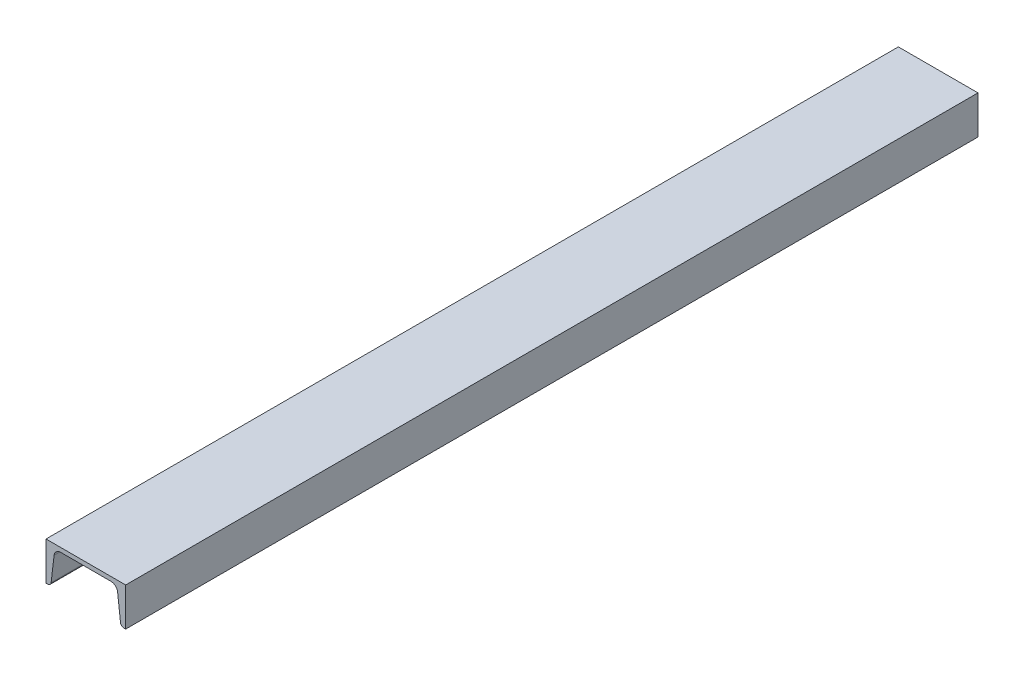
from build123d import *

# Parameters (mm, degrees)
EXTRUDE_1_DEPTH = 1070


with BuildPart() as part:
    # Sketch 1 → Extrude 1 (new body)
    with BuildSketch(Plane.XY):
        with BuildLine():
            Line((-50, 0), (50, 0))
            Line((50, 0), (50, -48))
            Line((50, -48), (47.825866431, -48))
            ThreePointArc((47.825866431, -48), (44.96758136, -46.912507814), (43.555046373, -44.200096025))
            Line((43.555046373, -44.200096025), (39.879559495, -12.811438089))
            ThreePointArc((39.879559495, -12.811438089), (37.087339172, -7.449693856), (31.437240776, -5.3))
            Line((31.437240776, -5.3), (-31.437240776, -5.3))
            ThreePointArc((-31.437240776, -5.3), (-37.087339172, -7.449693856), (-39.879559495, -12.811438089))
            Line((-39.879559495, -12.811438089), (-43.555046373, -44.200096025))
            ThreePointArc((-43.555046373, -44.200096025), (-44.96758136, -46.912507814), (-47.825866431, -48))
            Line((-47.825866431, -48), (-50, -48))
            Line((-50, -48), (-50, 0))
        make_face()
    extrude(amount=EXTRUDE_1_DEPTH)


solid = part.part
